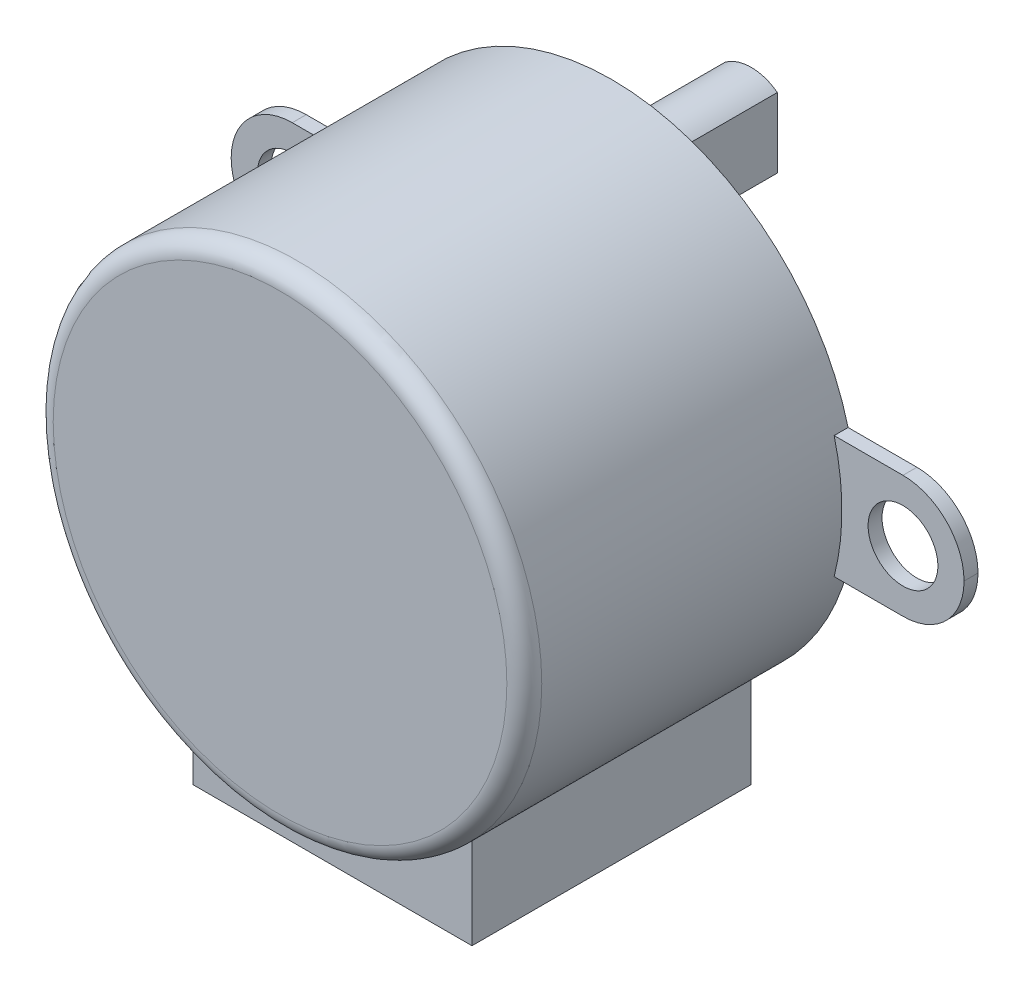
ISO-10303-21;
HEADER;
FILE_DESCRIPTION(('STEP AP214'),'2;1');
FILE_NAME('part.step','',(''),(''),'','','');
FILE_SCHEMA(('AUTOMOTIVE_DESIGN { 1 0 10303 214 1 1 1 1 }'));
ENDSEC;
DATA;
#1=APPLICATION_CONTEXT('core data for automotive mechanical design processes');
#2=APPLICATION_PROTOCOL_DEFINITION('international standard','automotive_design',2000,#1);
#3=PRODUCT_CONTEXT('',#1,'mechanical');
#4=PRODUCT('Part','Part','',(#3));
#5=PRODUCT_RELATED_PRODUCT_CATEGORY('part','',(#4));
#6=PRODUCT_DEFINITION_FORMATION('','',#4);
#7=PRODUCT_DEFINITION_CONTEXT('part definition',#1,'design');
#8=PRODUCT_DEFINITION('design','',#6,#7);
#9=PRODUCT_DEFINITION_SHAPE('','',#8);
#10=(LENGTH_UNIT() NAMED_UNIT(*) SI_UNIT(.MILLI.,.METRE.));
#11=(NAMED_UNIT(*) PLANE_ANGLE_UNIT() SI_UNIT($,.RADIAN.));
#12=(NAMED_UNIT(*) SI_UNIT($,.STERADIAN.) SOLID_ANGLE_UNIT());
#13=UNCERTAINTY_MEASURE_WITH_UNIT(LENGTH_MEASURE(1.E-05),#10,'distance_accuracy_value','');
#14=(GEOMETRIC_REPRESENTATION_CONTEXT(3) GLOBAL_UNCERTAINTY_ASSIGNED_CONTEXT((#13)) GLOBAL_UNIT_ASSIGNED_CONTEXT((#10,
#11,#12)) REPRESENTATION_CONTEXT('',''));
#15=CARTESIAN_POINT('',(0.,0.,0.));
#16=DIRECTION('',(0.,0.,1.));
#17=DIRECTION('',(1.,0.,0.));
#18=AXIS2_PLACEMENT_3D('',#15,#16,#17);
#19=CARTESIAN_POINT('',(0.,8.1,-1.));
#20=DIRECTION('',(0.,0.,-1.));
#21=DIRECTION('',(-1.,0.,0.));
#22=AXIS2_PLACEMENT_3D('',#19,#20,#21);
#23=PLANE('',#22);
#24=CARTESIAN_POINT('',(0.,8.1,-1.));
#25=DIRECTION('',(0.,0.,-1.));
#26=DIRECTION('',(-1.,0.,0.));
#27=AXIS2_PLACEMENT_3D('',#24,#25,#26);
#28=CIRCLE('',#27,4.6);
#29=CARTESIAN_POINT('',(-4.6,8.1,-1.));
#30=VERTEX_POINT('',#29);
#31=EDGE_CURVE('E175',#30,#30,#28,.T.);
#32=ORIENTED_EDGE('',*,*,#31,.T.);
#33=EDGE_LOOP('',(#32));
#34=FACE_BOUND('',#33,.T.);
#35=CARTESIAN_POINT('',(0.,8.1,-1.));
#36=DIRECTION('',(0.,0.,-1.));
#37=DIRECTION('',(-1.,0.,0.));
#38=AXIS2_PLACEMENT_3D('',#35,#36,#37);
#39=CIRCLE('',#38,2.5);
#40=CARTESIAN_POINT('',(-2.5,8.1,-1.));
#41=VERTEX_POINT('',#40);
#42=EDGE_CURVE('E181',#41,#41,#39,.T.);
#43=ORIENTED_EDGE('',*,*,#42,.F.);
#44=EDGE_LOOP('',(#43));
#45=FACE_BOUND('',#44,.T.);
#46=ADVANCED_FACE('F33',(#34,#45),#23,.T.);
#47=CARTESIAN_POINT('',(0.,0.,0.));
#48=DIRECTION('',(0.,0.,1.));
#49=DIRECTION('',(1.,0.,0.));
#50=AXIS2_PLACEMENT_3D('',#47,#48,#49);
#51=PLANE('',#50);
#52=CARTESIAN_POINT('',(17.5,0.,0.));
#53=DIRECTION('',(0.,0.,1.));
#54=DIRECTION('',(1.,0.,0.));
#55=AXIS2_PLACEMENT_3D('',#52,#53,#54);
#56=CIRCLE('',#55,3.5);
#57=CARTESIAN_POINT('',(17.5,3.5,0.));
#58=VERTEX_POINT('',#57);
#59=CARTESIAN_POINT('',(21.,0.,0.));
#60=VERTEX_POINT('',#59);
#61=EDGE_CURVE('E271',#58,#60,#56,.F.);
#62=ORIENTED_EDGE('',*,*,#61,.T.);
#63=CARTESIAN_POINT('',(17.5,0.,0.));
#64=DIRECTION('',(0.,0.,1.));
#65=DIRECTION('',(1.,0.,0.));
#66=AXIS2_PLACEMENT_3D('',#63,#64,#65);
#67=CIRCLE('',#66,3.5);
#68=CARTESIAN_POINT('',(17.5,-3.5,0.));
#69=VERTEX_POINT('',#68);
#70=EDGE_CURVE('E273',#60,#69,#67,.F.);
#71=ORIENTED_EDGE('',*,*,#70,.T.);
#72=DIRECTION('',(-1.,0.,0.));
#73=VECTOR('',#72,1.);
#74=CARTESIAN_POINT('',(21.,-3.5,0.));
#75=LINE('',#74,#73);
#76=CARTESIAN_POINT('',(13.555441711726,-3.5,0.));
#77=VERTEX_POINT('',#76);
#78=EDGE_CURVE('E210',#69,#77,#75,.T.);
#79=ORIENTED_EDGE('',*,*,#78,.T.);
#80=CARTESIAN_POINT('',(0.,0.,0.));
#81=DIRECTION('',(0.,0.,1.));
#82=DIRECTION('',(1.,0.,0.));
#83=AXIS2_PLACEMENT_3D('',#80,#81,#82);
#84=CIRCLE('',#83,14.);
#85=CARTESIAN_POINT('',(8.,-11.4891252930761,0.));
#86=VERTEX_POINT('',#85);
#87=EDGE_CURVE('E250',#86,#77,#84,.T.);
#88=ORIENTED_EDGE('',*,*,#87,.F.);
#89=DIRECTION('',(0.,-1.,0.));
#90=VECTOR('',#89,1.);
#91=CARTESIAN_POINT('',(8.,-2.,0.));
#92=LINE('',#91,#90);
#93=CARTESIAN_POINT('',(8.,-17.,0.));
#94=VERTEX_POINT('',#93);
#95=EDGE_CURVE('E236',#86,#94,#92,.T.);
#96=ORIENTED_EDGE('',*,*,#95,.T.);
#97=DIRECTION('',(-1.,0.,0.));
#98=VECTOR('',#97,1.);
#99=CARTESIAN_POINT('',(8.,-17.,0.));
#100=LINE('',#99,#98);
#101=CARTESIAN_POINT('',(-8.,-17.,0.));
#102=VERTEX_POINT('',#101);
#103=EDGE_CURVE('E228',#94,#102,#100,.T.);
#104=ORIENTED_EDGE('',*,*,#103,.T.);
#105=DIRECTION('',(0.,1.,0.));
#106=VECTOR('',#105,1.);
#107=CARTESIAN_POINT('',(-8.,-2.,0.));
#108=LINE('',#107,#106);
#109=CARTESIAN_POINT('',(-8.,-11.4891252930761,0.));
#110=VERTEX_POINT('',#109);
#111=EDGE_CURVE('E223',#102,#110,#108,.T.);
#112=ORIENTED_EDGE('',*,*,#111,.T.);
#113=CARTESIAN_POINT('',(-13.5554417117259,-3.5,0.));
#114=VERTEX_POINT('',#113);
#115=EDGE_CURVE('E249',#114,#110,#84,.T.);
#116=ORIENTED_EDGE('',*,*,#115,.F.);
#117=CARTESIAN_POINT('',(-17.5,-3.5,0.));
#118=VERTEX_POINT('',#117);
#119=EDGE_CURVE('E208',#114,#118,#75,.T.);
#120=ORIENTED_EDGE('',*,*,#119,.T.);
#121=CARTESIAN_POINT('',(-17.5,0.,0.));
#122=DIRECTION('',(0.,0.,1.));
#123=DIRECTION('',(1.,0.,0.));
#124=AXIS2_PLACEMENT_3D('',#121,#122,#123);
#125=CIRCLE('',#124,3.5);
#126=CARTESIAN_POINT('',(-21.,0.,0.));
#127=VERTEX_POINT('',#126);
#128=EDGE_CURVE('E269',#118,#127,#125,.F.);
#129=ORIENTED_EDGE('',*,*,#128,.T.);
#130=CARTESIAN_POINT('',(-17.5,0.,0.));
#131=DIRECTION('',(0.,0.,1.));
#132=DIRECTION('',(1.,0.,0.));
#133=AXIS2_PLACEMENT_3D('',#130,#131,#132);
#134=CIRCLE('',#133,3.5);
#135=CARTESIAN_POINT('',(-17.5,3.5,0.));
#136=VERTEX_POINT('',#135);
#137=EDGE_CURVE('E267',#127,#136,#134,.F.);
#138=ORIENTED_EDGE('',*,*,#137,.T.);
#139=DIRECTION('',(1.,0.,0.));
#140=VECTOR('',#139,1.);
#141=CARTESIAN_POINT('',(21.,3.5,0.));
#142=LINE('',#141,#140);
#143=CARTESIAN_POINT('',(-13.555441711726,3.5,0.));
#144=VERTEX_POINT('',#143);
#145=EDGE_CURVE('E206',#136,#144,#142,.T.);
#146=ORIENTED_EDGE('',*,*,#145,.T.);
#147=CARTESIAN_POINT('',(13.555441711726,3.5,0.));
#148=VERTEX_POINT('',#147);
#149=EDGE_CURVE('E254',#148,#144,#84,.T.);
#150=ORIENTED_EDGE('',*,*,#149,.F.);
#151=EDGE_CURVE('E209',#148,#58,#142,.T.);
#152=ORIENTED_EDGE('',*,*,#151,.T.);
#153=EDGE_LOOP('',(#62,#71,#79,#88,#96,#104,#112,#116,#120,#129,#138,#146,#150,#152));
#154=FACE_BOUND('',#153,.T.);
#155=CARTESIAN_POINT('',(17.5,0.,0.));
#156=DIRECTION('',(0.,0.,-1.));
#157=DIRECTION('',(-1.,0.,0.));
#158=AXIS2_PLACEMENT_3D('',#155,#156,#157);
#159=CIRCLE('',#158,2.);
#160=CARTESIAN_POINT('',(15.5,0.,0.));
#161=VERTEX_POINT('',#160);
#162=EDGE_CURVE('E190',#161,#161,#159,.T.);
#163=ORIENTED_EDGE('',*,*,#162,.F.);
#164=EDGE_LOOP('',(#163));
#165=FACE_BOUND('',#164,.T.);
#166=CARTESIAN_POINT('',(-17.5,0.,0.));
#167=DIRECTION('',(0.,0.,-1.));
#168=DIRECTION('',(1.,0.,0.));
#169=AXIS2_PLACEMENT_3D('',#166,#167,#168);
#170=CIRCLE('',#169,2.);
#171=CARTESIAN_POINT('',(-15.5,0.,0.));
#172=VERTEX_POINT('',#171);
#173=EDGE_CURVE('E179',#172,#172,#170,.T.);
#174=ORIENTED_EDGE('',*,*,#173,.F.);
#175=EDGE_LOOP('',(#174));
#176=FACE_BOUND('',#175,.T.);
#177=CARTESIAN_POINT('',(0.,8.1,0.));
#178=DIRECTION('',(0.,0.,1.));
#179=DIRECTION('',(1.,0.,0.));
#180=AXIS2_PLACEMENT_3D('',#177,#178,#179);
#181=CIRCLE('',#180,4.6);
#182=CARTESIAN_POINT('',(4.6,8.1,0.));
#183=VERTEX_POINT('',#182);
#184=EDGE_CURVE('E293',#183,#183,#181,.F.);
#185=ORIENTED_EDGE('',*,*,#184,.F.);
#186=EDGE_LOOP('',(#185));
#187=FACE_BOUND('',#186,.T.);
#188=ADVANCED_FACE('F324',(#154,#165,#176,#187),#51,.F.);
#189=CARTESIAN_POINT('',(0.,0.,19.));
#190=DIRECTION('',(0.,0.,-1.));
#191=DIRECTION('',(-1.,0.,0.));
#192=AXIS2_PLACEMENT_3D('',#189,#190,#191);
#193=CYLINDRICAL_SURFACE('',#192,14.);
#194=ORIENTED_EDGE('',*,*,#87,.T.);
#195=DIRECTION('',(0.,0.,-1.));
#196=VECTOR('',#195,1.);
#197=CARTESIAN_POINT('',(13.555441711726,-3.5,19.));
#198=LINE('',#197,#196);
#199=CARTESIAN_POINT('',(13.555441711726,-3.5,0.799999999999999));
#200=VERTEX_POINT('',#199);
#201=EDGE_CURVE('E217',#77,#200,#198,.F.);
#202=ORIENTED_EDGE('',*,*,#201,.T.);
#203=CARTESIAN_POINT('',(0.,0.,0.799999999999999));
#204=DIRECTION('',(0.,0.,-1.));
#205=DIRECTION('',(-1.,0.,0.));
#206=AXIS2_PLACEMENT_3D('',#203,#204,#205);
#207=CIRCLE('',#206,14.);
#208=CARTESIAN_POINT('',(13.555441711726,3.5,0.799999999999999));
#209=VERTEX_POINT('',#208);
#210=EDGE_CURVE('E266',#209,#200,#207,.T.);
#211=ORIENTED_EDGE('',*,*,#210,.F.);
#212=DIRECTION('',(0.,0.,-1.));
#213=VECTOR('',#212,1.);
#214=CARTESIAN_POINT('',(13.555441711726,3.5,19.));
#215=LINE('',#214,#213);
#216=EDGE_CURVE('E214',#209,#148,#215,.T.);
#217=ORIENTED_EDGE('',*,*,#216,.T.);
#218=ORIENTED_EDGE('',*,*,#149,.T.);
#219=DIRECTION('',(0.,0.,-1.));
#220=VECTOR('',#219,1.);
#221=CARTESIAN_POINT('',(-13.555441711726,3.5,19.));
#222=LINE('',#221,#220);
#223=CARTESIAN_POINT('',(-13.555441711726,3.5,0.799999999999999));
#224=VERTEX_POINT('',#223);
#225=EDGE_CURVE('E205',#144,#224,#222,.F.);
#226=ORIENTED_EDGE('',*,*,#225,.T.);
#227=CARTESIAN_POINT('',(-13.555441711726,-3.5,0.799999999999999));
#228=VERTEX_POINT('',#227);
#229=EDGE_CURVE('E263',#228,#224,#207,.T.);
#230=ORIENTED_EDGE('',*,*,#229,.F.);
#231=DIRECTION('',(0.,0.,-1.));
#232=VECTOR('',#231,1.);
#233=CARTESIAN_POINT('',(-13.555441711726,-3.5,19.));
#234=LINE('',#233,#232);
#235=EDGE_CURVE('E220',#228,#114,#234,.T.);
#236=ORIENTED_EDGE('',*,*,#235,.T.);
#237=ORIENTED_EDGE('',*,*,#115,.T.);
#238=DIRECTION('',(0.,0.,-1.));
#239=VECTOR('',#238,1.);
#240=CARTESIAN_POINT('',(-8.,-11.4891252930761,19.));
#241=LINE('',#240,#239);
#242=CARTESIAN_POINT('',(-8.,-11.4891252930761,16.));
#243=VERTEX_POINT('',#242);
#244=EDGE_CURVE('E247',#110,#243,#241,.F.);
#245=ORIENTED_EDGE('',*,*,#244,.T.);
#246=CARTESIAN_POINT('',(0.,0.,16.));
#247=DIRECTION('',(0.,0.,-1.));
#248=DIRECTION('',(-1.,0.,0.));
#249=AXIS2_PLACEMENT_3D('',#246,#247,#248);
#250=CIRCLE('',#249,14.);
#251=CARTESIAN_POINT('',(8.,-11.4891252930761,16.));
#252=VERTEX_POINT('',#251);
#253=EDGE_CURVE('E253',#252,#243,#250,.T.);
#254=ORIENTED_EDGE('',*,*,#253,.F.);
#255=DIRECTION('',(0.,0.,-1.));
#256=VECTOR('',#255,1.);
#257=CARTESIAN_POINT('',(8.,-11.4891252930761,19.));
#258=LINE('',#257,#256);
#259=EDGE_CURVE('E242',#252,#86,#258,.T.);
#260=ORIENTED_EDGE('',*,*,#259,.T.);
#261=EDGE_LOOP('',(#194,#202,#211,#217,#218,#226,#230,#236,#237,#245,#254,#260));
#262=FACE_BOUND('',#261,.T.);
#263=CARTESIAN_POINT('',(0.,0.,18.));
#264=DIRECTION('',(0.,0.,1.));
#265=DIRECTION('',(1.,0.,0.));
#266=AXIS2_PLACEMENT_3D('',#263,#264,#265);
#267=CIRCLE('',#266,14.);
#268=CARTESIAN_POINT('',(14.,0.,18.));
#269=VERTEX_POINT('',#268);
#270=EDGE_CURVE('E260',#269,#269,#267,.F.);
#271=ORIENTED_EDGE('',*,*,#270,.T.);
#272=EDGE_LOOP('',(#271));
#273=FACE_BOUND('',#272,.T.);
#274=ADVANCED_FACE('F330',(#262,#273),#193,.T.);
#275=CARTESIAN_POINT('',(0.,0.,19.));
#276=DIRECTION('',(0.,0.,1.));
#277=DIRECTION('',(1.,0.,0.));
#278=AXIS2_PLACEMENT_3D('',#275,#276,#277);
#279=PLANE('',#278);
#280=CARTESIAN_POINT('',(0.,0.,19.));
#281=DIRECTION('',(0.,0.,1.));
#282=DIRECTION('',(1.,0.,0.));
#283=AXIS2_PLACEMENT_3D('',#280,#281,#282);
#284=CIRCLE('',#283,13.);
#285=CARTESIAN_POINT('',(13.,0.,19.));
#286=VERTEX_POINT('',#285);
#287=EDGE_CURVE('E257',#286,#286,#284,.T.);
#288=ORIENTED_EDGE('',*,*,#287,.T.);
#289=EDGE_LOOP('',(#288));
#290=FACE_BOUND('',#289,.T.);
#291=ADVANCED_FACE('F370',(#290),#279,.T.);
#292=CARTESIAN_POINT('',(0.,0.,16.));
#293=DIRECTION('',(0.,0.,-1.));
#294=DIRECTION('',(-1.,0.,0.));
#295=AXIS2_PLACEMENT_3D('',#292,#293,#294);
#296=PLANE('',#295);
#297=DIRECTION('',(0.,-1.,0.));
#298=VECTOR('',#297,1.);
#299=CARTESIAN_POINT('',(8.,-2.,16.));
#300=LINE('',#299,#298);
#301=CARTESIAN_POINT('',(8.,-17.,16.));
#302=VERTEX_POINT('',#301);
#303=EDGE_CURVE('E227',#252,#302,#300,.T.);
#304=ORIENTED_EDGE('',*,*,#303,.F.);
#305=ORIENTED_EDGE('',*,*,#253,.T.);
#306=DIRECTION('',(0.,1.,0.));
#307=VECTOR('',#306,1.);
#308=CARTESIAN_POINT('',(-8.,-2.,16.));
#309=LINE('',#308,#307);
#310=CARTESIAN_POINT('',(-8.,-17.,16.));
#311=VERTEX_POINT('',#310);
#312=EDGE_CURVE('E224',#311,#243,#309,.T.);
#313=ORIENTED_EDGE('',*,*,#312,.F.);
#314=DIRECTION('',(-1.,0.,0.));
#315=VECTOR('',#314,1.);
#316=CARTESIAN_POINT('',(8.,-17.,16.));
#317=LINE('',#316,#315);
#318=EDGE_CURVE('E230',#302,#311,#317,.T.);
#319=ORIENTED_EDGE('',*,*,#318,.F.);
#320=EDGE_LOOP('',(#304,#305,#313,#319));
#321=FACE_BOUND('',#320,.T.);
#322=ADVANCED_FACE('F366',(#321),#296,.F.);
#323=CARTESIAN_POINT('',(-8.,-2.,16.));
#324=DIRECTION('',(-1.,0.,0.));
#325=DIRECTION('',(0.,-1.,0.));
#326=AXIS2_PLACEMENT_3D('',#323,#324,#325);
#327=PLANE('',#326);
#328=ORIENTED_EDGE('',*,*,#244,.F.);
#329=ORIENTED_EDGE('',*,*,#111,.F.);
#330=DIRECTION('',(0.,0.,-1.));
#331=VECTOR('',#330,1.);
#332=CARTESIAN_POINT('',(-8.,-17.,16.));
#333=LINE('',#332,#331);
#334=EDGE_CURVE('E240',#311,#102,#333,.T.);
#335=ORIENTED_EDGE('',*,*,#334,.F.);
#336=ORIENTED_EDGE('',*,*,#312,.T.);
#337=EDGE_LOOP('',(#328,#329,#335,#336));
#338=FACE_BOUND('',#337,.T.);
#339=ADVANCED_FACE('F369',(#338),#327,.T.);
#340=CARTESIAN_POINT('',(8.,-2.,16.));
#341=DIRECTION('',(1.,0.,0.));
#342=DIRECTION('',(0.,1.,0.));
#343=AXIS2_PLACEMENT_3D('',#340,#341,#342);
#344=PLANE('',#343);
#345=ORIENTED_EDGE('',*,*,#259,.F.);
#346=ORIENTED_EDGE('',*,*,#303,.T.);
#347=DIRECTION('',(0.,0.,-1.));
#348=VECTOR('',#347,1.);
#349=CARTESIAN_POINT('',(8.,-17.,16.));
#350=LINE('',#349,#348);
#351=EDGE_CURVE('E233',#302,#94,#350,.T.);
#352=ORIENTED_EDGE('',*,*,#351,.T.);
#353=ORIENTED_EDGE('',*,*,#95,.F.);
#354=EDGE_LOOP('',(#345,#346,#352,#353));
#355=FACE_BOUND('',#354,.T.);
#356=ADVANCED_FACE('F376',(#355),#344,.T.);
#357=CARTESIAN_POINT('',(8.,-17.,16.));
#358=DIRECTION('',(0.,-1.,0.));
#359=DIRECTION('',(0.,0.,-1.));
#360=AXIS2_PLACEMENT_3D('',#357,#358,#359);
#361=PLANE('',#360);
#362=ORIENTED_EDGE('',*,*,#103,.F.);
#363=ORIENTED_EDGE('',*,*,#351,.F.);
#364=ORIENTED_EDGE('',*,*,#318,.T.);
#365=ORIENTED_EDGE('',*,*,#334,.T.);
#366=EDGE_LOOP('',(#362,#363,#364,#365));
#367=FACE_BOUND('',#366,.T.);
#368=ADVANCED_FACE('F372',(#367),#361,.T.);
#369=CARTESIAN_POINT('',(0.,0.,18.));
#370=DIRECTION('',(0.,0.,1.));
#371=DIRECTION('',(1.,0.,0.));
#372=AXIS2_PLACEMENT_3D('',#369,#370,#371);
#373=TOROIDAL_SURFACE('',#372,13.,1.);
#374=ORIENTED_EDGE('',*,*,#270,.F.);
#375=EDGE_LOOP('',(#374));
#376=FACE_BOUND('',#375,.T.);
#377=ORIENTED_EDGE('',*,*,#287,.F.);
#378=EDGE_LOOP('',(#377));
#379=FACE_BOUND('',#378,.T.);
#380=ADVANCED_FACE('F375',(#376,#379),#373,.T.);
#381=CARTESIAN_POINT('',(0.,0.,0.8));
#382=DIRECTION('',(0.,0.,-1.));
#383=DIRECTION('',(-1.,0.,0.));
#384=AXIS2_PLACEMENT_3D('',#381,#382,#383);
#385=PLANE('',#384);
#386=CARTESIAN_POINT('',(-17.5,0.,0.8));
#387=DIRECTION('',(0.,0.,-1.));
#388=DIRECTION('',(1.,0.,0.));
#389=AXIS2_PLACEMENT_3D('',#386,#387,#388);
#390=CIRCLE('',#389,2.);
#391=CARTESIAN_POINT('',(-15.5,0.,0.8));
#392=VERTEX_POINT('',#391);
#393=EDGE_CURVE('E187',#392,#392,#390,.T.);
#394=ORIENTED_EDGE('',*,*,#393,.T.);
#395=EDGE_LOOP('',(#394));
#396=FACE_BOUND('',#395,.T.);
#397=CARTESIAN_POINT('',(-17.5,0.,0.8));
#398=DIRECTION('',(0.,0.,-1.));
#399=DIRECTION('',(-1.,0.,0.));
#400=AXIS2_PLACEMENT_3D('',#397,#398,#399);
#401=CIRCLE('',#400,3.5);
#402=CARTESIAN_POINT('',(-17.5,3.5,0.8));
#403=VERTEX_POINT('',#402);
#404=CARTESIAN_POINT('',(-21.,0.,0.8));
#405=VERTEX_POINT('',#404);
#406=EDGE_CURVE('E287',#403,#405,#401,.F.);
#407=ORIENTED_EDGE('',*,*,#406,.T.);
#408=CARTESIAN_POINT('',(-17.5,0.,0.8));
#409=DIRECTION('',(0.,0.,-1.));
#410=DIRECTION('',(-1.,0.,0.));
#411=AXIS2_PLACEMENT_3D('',#408,#409,#410);
#412=CIRCLE('',#411,3.5);
#413=CARTESIAN_POINT('',(-17.5,-3.5,0.8));
#414=VERTEX_POINT('',#413);
#415=EDGE_CURVE('E289',#405,#414,#412,.F.);
#416=ORIENTED_EDGE('',*,*,#415,.T.);
#417=DIRECTION('',(-1.,0.,0.));
#418=VECTOR('',#417,1.);
#419=CARTESIAN_POINT('',(21.,-3.5,0.8));
#420=LINE('',#419,#418);
#421=EDGE_CURVE('E201',#228,#414,#420,.T.);
#422=ORIENTED_EDGE('',*,*,#421,.F.);
#423=ORIENTED_EDGE('',*,*,#229,.T.);
#424=DIRECTION('',(1.,0.,0.));
#425=VECTOR('',#424,1.);
#426=CARTESIAN_POINT('',(21.,3.5,0.8));
#427=LINE('',#426,#425);
#428=EDGE_CURVE('E199',#403,#224,#427,.T.);
#429=ORIENTED_EDGE('',*,*,#428,.F.);
#430=EDGE_LOOP('',(#407,#416,#422,#423,#429));
#431=FACE_BOUND('',#430,.T.);
#432=ADVANCED_FACE('F356',(#396,#431),#385,.F.);
#433=CARTESIAN_POINT('',(21.,3.5,0.8));
#434=DIRECTION('',(0.,1.,0.));
#435=DIRECTION('',(0.,0.,1.));
#436=AXIS2_PLACEMENT_3D('',#433,#434,#435);
#437=PLANE('',#436);
#438=ORIENTED_EDGE('',*,*,#145,.F.);
#439=DIRECTION('',(0.,0.,-1.));
#440=VECTOR('',#439,1.);
#441=CARTESIAN_POINT('',(-17.5,3.5,0.8));
#442=LINE('',#441,#440);
#443=EDGE_CURVE('E291',#136,#403,#442,.F.);
#444=ORIENTED_EDGE('',*,*,#443,.T.);
#445=ORIENTED_EDGE('',*,*,#428,.T.);
#446=ORIENTED_EDGE('',*,*,#225,.F.);
#447=EDGE_LOOP('',(#438,#444,#445,#446));
#448=FACE_BOUND('',#447,.T.);
#449=ADVANCED_FACE('F359',(#448),#437,.T.);
#450=CARTESIAN_POINT('',(21.,-3.5,0.8));
#451=DIRECTION('',(0.,-1.,0.));
#452=DIRECTION('',(0.,0.,-1.));
#453=AXIS2_PLACEMENT_3D('',#450,#451,#452);
#454=PLANE('',#453);
#455=ORIENTED_EDGE('',*,*,#421,.T.);
#456=DIRECTION('',(0.,0.,-1.));
#457=VECTOR('',#456,1.);
#458=CARTESIAN_POINT('',(-17.5,-3.5,0.8));
#459=LINE('',#458,#457);
#460=EDGE_CURVE('E284',#414,#118,#459,.T.);
#461=ORIENTED_EDGE('',*,*,#460,.T.);
#462=ORIENTED_EDGE('',*,*,#119,.F.);
#463=ORIENTED_EDGE('',*,*,#235,.F.);
#464=EDGE_LOOP('',(#455,#461,#462,#463));
#465=FACE_BOUND('',#464,.T.);
#466=ADVANCED_FACE('F354',(#465),#454,.T.);
#467=CARTESIAN_POINT('',(17.5,0.,0.8));
#468=DIRECTION('',(0.,0.,-1.));
#469=DIRECTION('',(-1.,0.,0.));
#470=AXIS2_PLACEMENT_3D('',#467,#468,#469);
#471=CIRCLE('',#470,2.);
#472=CARTESIAN_POINT('',(15.5,0.,0.8));
#473=VERTEX_POINT('',#472);
#474=EDGE_CURVE('E193',#473,#473,#471,.T.);
#475=ORIENTED_EDGE('',*,*,#474,.T.);
#476=EDGE_LOOP('',(#475));
#477=FACE_BOUND('',#476,.T.);
#478=CARTESIAN_POINT('',(17.5,-3.5,0.8));
#479=VERTEX_POINT('',#478);
#480=EDGE_CURVE('E203',#479,#200,#420,.T.);
#481=ORIENTED_EDGE('',*,*,#480,.F.);
#482=CARTESIAN_POINT('',(17.5,0.,0.8));
#483=DIRECTION('',(0.,0.,-1.));
#484=DIRECTION('',(-1.,0.,0.));
#485=AXIS2_PLACEMENT_3D('',#482,#483,#484);
#486=CIRCLE('',#485,3.5);
#487=CARTESIAN_POINT('',(21.,0.,0.8));
#488=VERTEX_POINT('',#487);
#489=EDGE_CURVE('E280',#479,#488,#486,.F.);
#490=ORIENTED_EDGE('',*,*,#489,.T.);
#491=CARTESIAN_POINT('',(17.5,0.,0.8));
#492=DIRECTION('',(0.,0.,-1.));
#493=DIRECTION('',(-1.,0.,0.));
#494=AXIS2_PLACEMENT_3D('',#491,#492,#493);
#495=CIRCLE('',#494,3.5);
#496=CARTESIAN_POINT('',(17.5,3.5,0.8));
#497=VERTEX_POINT('',#496);
#498=EDGE_CURVE('E278',#488,#497,#495,.F.);
#499=ORIENTED_EDGE('',*,*,#498,.T.);
#500=EDGE_CURVE('E202',#209,#497,#427,.T.);
#501=ORIENTED_EDGE('',*,*,#500,.F.);
#502=ORIENTED_EDGE('',*,*,#210,.T.);
#503=EDGE_LOOP('',(#481,#490,#499,#501,#502));
#504=FACE_BOUND('',#503,.T.);
#505=ADVANCED_FACE('F350',(#477,#504),#385,.F.);
#506=ORIENTED_EDGE('',*,*,#78,.F.);
#507=DIRECTION('',(0.,0.,-1.));
#508=VECTOR('',#507,1.);
#509=CARTESIAN_POINT('',(17.5,-3.5,0.8));
#510=LINE('',#509,#508);
#511=EDGE_CURVE('E275',#69,#479,#510,.F.);
#512=ORIENTED_EDGE('',*,*,#511,.T.);
#513=ORIENTED_EDGE('',*,*,#480,.T.);
#514=ORIENTED_EDGE('',*,*,#201,.F.);
#515=EDGE_LOOP('',(#506,#512,#513,#514));
#516=FACE_BOUND('',#515,.T.);
#517=ADVANCED_FACE('F353',(#516),#454,.T.);
#518=ORIENTED_EDGE('',*,*,#500,.T.);
#519=DIRECTION('',(0.,0.,-1.));
#520=VECTOR('',#519,1.);
#521=CARTESIAN_POINT('',(17.5,3.5,0.8));
#522=LINE('',#521,#520);
#523=EDGE_CURVE('E282',#497,#58,#522,.T.);
#524=ORIENTED_EDGE('',*,*,#523,.T.);
#525=ORIENTED_EDGE('',*,*,#151,.F.);
#526=ORIENTED_EDGE('',*,*,#216,.F.);
#527=EDGE_LOOP('',(#518,#524,#525,#526));
#528=FACE_BOUND('',#527,.T.);
#529=ADVANCED_FACE('F361',(#528),#437,.T.);
#530=CARTESIAN_POINT('',(17.5,0.,0.8));
#531=DIRECTION('',(0.,0.,-1.));
#532=DIRECTION('',(-1.,0.,0.));
#533=AXIS2_PLACEMENT_3D('',#530,#531,#532);
#534=CYLINDRICAL_SURFACE('',#533,3.5);
#535=ORIENTED_EDGE('',*,*,#523,.F.);
#536=ORIENTED_EDGE('',*,*,#498,.F.);
#537=DIRECTION('',(0.,0.,-1.));
#538=VECTOR('',#537,1.);
#539=CARTESIAN_POINT('',(21.,0.,0.8));
#540=LINE('',#539,#538);
#541=EDGE_CURVE('E294',#60,#488,#540,.F.);
#542=ORIENTED_EDGE('',*,*,#541,.F.);
#543=ORIENTED_EDGE('',*,*,#61,.F.);
#544=EDGE_LOOP('',(#535,#536,#542,#543));
#545=FACE_BOUND('',#544,.T.);
#546=ADVANCED_FACE('F364',(#545),#534,.T.);
#547=CARTESIAN_POINT('',(17.5,0.,0.8));
#548=DIRECTION('',(0.,0.,-1.));
#549=DIRECTION('',(-1.,0.,0.));
#550=AXIS2_PLACEMENT_3D('',#547,#548,#549);
#551=CYLINDRICAL_SURFACE('',#550,3.5);
#552=ORIENTED_EDGE('',*,*,#489,.F.);
#553=ORIENTED_EDGE('',*,*,#511,.F.);
#554=ORIENTED_EDGE('',*,*,#70,.F.);
#555=ORIENTED_EDGE('',*,*,#541,.T.);
#556=EDGE_LOOP('',(#552,#553,#554,#555));
#557=FACE_BOUND('',#556,.T.);
#558=ADVANCED_FACE('F393',(#557),#551,.T.);
#559=CARTESIAN_POINT('',(-17.5,0.,0.8));
#560=DIRECTION('',(0.,0.,-1.));
#561=DIRECTION('',(-1.,0.,0.));
#562=AXIS2_PLACEMENT_3D('',#559,#560,#561);
#563=CYLINDRICAL_SURFACE('',#562,3.5);
#564=DIRECTION('',(0.,0.,-1.));
#565=VECTOR('',#564,1.);
#566=CARTESIAN_POINT('',(-21.,0.,0.8));
#567=LINE('',#566,#565);
#568=EDGE_CURVE('E196',#405,#127,#567,.T.);
#569=ORIENTED_EDGE('',*,*,#568,.F.);
#570=ORIENTED_EDGE('',*,*,#406,.F.);
#571=ORIENTED_EDGE('',*,*,#443,.F.);
#572=ORIENTED_EDGE('',*,*,#137,.F.);
#573=EDGE_LOOP('',(#569,#570,#571,#572));
#574=FACE_BOUND('',#573,.T.);
#575=ADVANCED_FACE('F35',(#574),#563,.T.);
#576=CARTESIAN_POINT('',(-17.5,0.,0.8));
#577=DIRECTION('',(0.,0.,-1.));
#578=DIRECTION('',(-1.,0.,0.));
#579=AXIS2_PLACEMENT_3D('',#576,#577,#578);
#580=CYLINDRICAL_SURFACE('',#579,3.5);
#581=ORIENTED_EDGE('',*,*,#415,.F.);
#582=ORIENTED_EDGE('',*,*,#568,.T.);
#583=ORIENTED_EDGE('',*,*,#128,.F.);
#584=ORIENTED_EDGE('',*,*,#460,.F.);
#585=EDGE_LOOP('',(#581,#582,#583,#584));
#586=FACE_BOUND('',#585,.T.);
#587=ADVANCED_FACE('F348',(#586),#580,.T.);
#588=CARTESIAN_POINT('',(17.5,0.,0.8));
#589=DIRECTION('',(0.,0.,-1.));
#590=DIRECTION('',(-1.,0.,0.));
#591=AXIS2_PLACEMENT_3D('',#588,#589,#590);
#592=CYLINDRICAL_SURFACE('',#591,2.);
#593=ORIENTED_EDGE('',*,*,#474,.F.);
#594=EDGE_LOOP('',(#593));
#595=FACE_BOUND('',#594,.T.);
#596=ORIENTED_EDGE('',*,*,#162,.T.);
#597=EDGE_LOOP('',(#596));
#598=FACE_BOUND('',#597,.T.);
#599=ADVANCED_FACE('F344',(#595,#598),#592,.F.);
#600=CARTESIAN_POINT('',(-17.5,0.,0.8));
#601=DIRECTION('',(0.,0.,-1.));
#602=DIRECTION('',(-1.,0.,0.));
#603=AXIS2_PLACEMENT_3D('',#600,#601,#602);
#604=CYLINDRICAL_SURFACE('',#603,2.);
#605=ORIENTED_EDGE('',*,*,#393,.F.);
#606=EDGE_LOOP('',(#605));
#607=FACE_BOUND('',#606,.T.);
#608=ORIENTED_EDGE('',*,*,#173,.T.);
#609=EDGE_LOOP('',(#608));
#610=FACE_BOUND('',#609,.T.);
#611=ADVANCED_FACE('F340',(#607,#610),#604,.F.);
#612=CARTESIAN_POINT('',(0.,8.1,-1.));
#613=DIRECTION('',(0.,0.,1.));
#614=DIRECTION('',(1.,0.,0.));
#615=AXIS2_PLACEMENT_3D('',#612,#613,#614);
#616=CYLINDRICAL_SURFACE('',#615,4.6);
#617=ORIENTED_EDGE('',*,*,#31,.F.);
#618=EDGE_LOOP('',(#617));
#619=FACE_BOUND('',#618,.T.);
#620=ORIENTED_EDGE('',*,*,#184,.T.);
#621=EDGE_LOOP('',(#620));
#622=FACE_BOUND('',#621,.T.);
#623=ADVANCED_FACE('F337',(#619,#622),#616,.T.);
#624=CARTESIAN_POINT('',(0.,8.1,-8.));
#625=DIRECTION('',(0.,0.,1.));
#626=DIRECTION('',(1.,0.,0.));
#627=AXIS2_PLACEMENT_3D('',#624,#625,#626);
#628=CYLINDRICAL_SURFACE('',#627,2.5);
#629=CARTESIAN_POINT('',(0.,8.1,-8.));
#630=DIRECTION('',(0.,0.,-1.));
#631=DIRECTION('',(-1.,0.,0.));
#632=AXIS2_PLACEMENT_3D('',#629,#630,#631);
#633=CIRCLE('',#632,2.5);
#634=CARTESIAN_POINT('',(1.5,6.1,-8.));
#635=VERTEX_POINT('',#634);
#636=CARTESIAN_POINT('',(-1.5,6.1,-8.));
#637=VERTEX_POINT('',#636);
#638=EDGE_CURVE('E176',#635,#637,#633,.T.);
#639=ORIENTED_EDGE('',*,*,#638,.F.);
#640=DIRECTION('',(0.,0.,1.));
#641=VECTOR('',#640,1.);
#642=CARTESIAN_POINT('',(1.5,6.1,-8.));
#643=LINE('',#642,#641);
#644=CARTESIAN_POINT('',(1.5,6.1,-3.));
#645=VERTEX_POINT('',#644);
#646=EDGE_CURVE('E48',#635,#645,#643,.T.);
#647=ORIENTED_EDGE('',*,*,#646,.T.);
#648=CARTESIAN_POINT('',(0.,8.1,-3.));
#649=DIRECTION('',(0.,0.,1.));
#650=DIRECTION('',(1.,0.,0.));
#651=AXIS2_PLACEMENT_3D('',#648,#649,#650);
#652=CIRCLE('',#651,2.5);
#653=CARTESIAN_POINT('',(1.5,10.1,-3.));
#654=VERTEX_POINT('',#653);
#655=EDGE_CURVE('E11',#645,#654,#652,.T.);
#656=ORIENTED_EDGE('',*,*,#655,.T.);
#657=DIRECTION('',(0.,0.,1.));
#658=VECTOR('',#657,1.);
#659=CARTESIAN_POINT('',(1.5,10.1,-8.));
#660=LINE('',#659,#658);
#661=CARTESIAN_POINT('',(1.5,10.1,-8.));
#662=VERTEX_POINT('',#661);
#663=EDGE_CURVE('E160',#654,#662,#660,.F.);
#664=ORIENTED_EDGE('',*,*,#663,.T.);
#665=CARTESIAN_POINT('',(-1.5,10.1,-8.));
#666=VERTEX_POINT('',#665);
#667=EDGE_CURVE('E170',#666,#662,#633,.T.);
#668=ORIENTED_EDGE('',*,*,#667,.F.);
#669=DIRECTION('',(0.,0.,1.));
#670=VECTOR('',#669,1.);
#671=CARTESIAN_POINT('',(-1.5,10.1,-8.));
#672=LINE('',#671,#670);
#673=CARTESIAN_POINT('',(-1.5,10.1,-3.));
#674=VERTEX_POINT('',#673);
#675=EDGE_CURVE('E56',#666,#674,#672,.T.);
#676=ORIENTED_EDGE('',*,*,#675,.T.);
#677=CARTESIAN_POINT('',(0.,8.1,-3.));
#678=DIRECTION('',(0.,0.,-1.));
#679=DIRECTION('',(-1.,0.,0.));
#680=AXIS2_PLACEMENT_3D('',#677,#678,#679);
#681=CIRCLE('',#680,2.5);
#682=CARTESIAN_POINT('',(-1.5,6.1,-3.));
#683=VERTEX_POINT('',#682);
#684=EDGE_CURVE('E165',#683,#674,#681,.T.);
#685=ORIENTED_EDGE('',*,*,#684,.F.);
#686=DIRECTION('',(0.,0.,1.));
#687=VECTOR('',#686,1.);
#688=CARTESIAN_POINT('',(-1.5,6.1,-8.));
#689=LINE('',#688,#687);
#690=EDGE_CURVE('E309',#683,#637,#689,.F.);
#691=ORIENTED_EDGE('',*,*,#690,.T.);
#692=EDGE_LOOP('',(#639,#647,#656,#664,#668,#676,#685,#691));
#693=FACE_BOUND('',#692,.T.);
#694=ORIENTED_EDGE('',*,*,#42,.T.);
#695=EDGE_LOOP('',(#694));
#696=FACE_BOUND('',#695,.T.);
#697=ADVANCED_FACE('F168',(#693,#696),#628,.T.);
#698=CARTESIAN_POINT('',(0.,8.1,-8.));
#699=DIRECTION('',(0.,0.,-1.));
#700=DIRECTION('',(-1.,0.,0.));
#701=AXIS2_PLACEMENT_3D('',#698,#699,#700);
#702=PLANE('',#701);
#703=DIRECTION('',(0.,1.,0.));
#704=VECTOR('',#703,1.);
#705=CARTESIAN_POINT('',(1.5,8.1,-8.));
#706=LINE('',#705,#704);
#707=EDGE_CURVE('E41',#635,#662,#706,.T.);
#708=ORIENTED_EDGE('',*,*,#707,.F.);
#709=ORIENTED_EDGE('',*,*,#638,.T.);
#710=DIRECTION('',(0.,-1.,0.));
#711=VECTOR('',#710,1.);
#712=CARTESIAN_POINT('',(-1.5,8.1,-8.));
#713=LINE('',#712,#711);
#714=EDGE_CURVE('E174',#666,#637,#713,.T.);
#715=ORIENTED_EDGE('',*,*,#714,.F.);
#716=ORIENTED_EDGE('',*,*,#667,.T.);
#717=EDGE_LOOP('',(#708,#709,#715,#716));
#718=FACE_BOUND('',#717,.T.);
#719=ADVANCED_FACE('F173',(#718),#702,.T.);
#720=CARTESIAN_POINT('',(0.,0.,-3.));
#721=DIRECTION('',(0.,0.,-1.));
#722=DIRECTION('',(-1.,0.,0.));
#723=AXIS2_PLACEMENT_3D('',#720,#721,#722);
#724=PLANE('',#723);
#725=ORIENTED_EDGE('',*,*,#684,.T.);
#726=DIRECTION('',(0.,-1.,0.));
#727=VECTOR('',#726,1.);
#728=CARTESIAN_POINT('',(-1.5,11.1338054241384,-3.));
#729=LINE('',#728,#727);
#730=EDGE_CURVE('E306',#674,#683,#729,.T.);
#731=ORIENTED_EDGE('',*,*,#730,.T.);
#732=EDGE_LOOP('',(#725,#731));
#733=FACE_BOUND('',#732,.T.);
#734=ADVANCED_FACE('F305',(#733),#724,.T.);
#735=CARTESIAN_POINT('',(-1.5,11.1338054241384,-3.));
#736=DIRECTION('',(1.,0.,0.));
#737=DIRECTION('',(0.,1.,0.));
#738=AXIS2_PLACEMENT_3D('',#735,#736,#737);
#739=PLANE('',#738);
#740=ORIENTED_EDGE('',*,*,#714,.T.);
#741=ORIENTED_EDGE('',*,*,#690,.F.);
#742=ORIENTED_EDGE('',*,*,#730,.F.);
#743=ORIENTED_EDGE('',*,*,#675,.F.);
#744=EDGE_LOOP('',(#740,#741,#742,#743));
#745=FACE_BOUND('',#744,.T.);
#746=ADVANCED_FACE('F308',(#745),#739,.F.);
#747=CARTESIAN_POINT('',(0.,0.,-3.));
#748=DIRECTION('',(0.,0.,1.));
#749=DIRECTION('',(1.,0.,0.));
#750=AXIS2_PLACEMENT_3D('',#747,#748,#749);
#751=PLANE('',#750);
#752=DIRECTION('',(0.,1.,0.));
#753=VECTOR('',#752,1.);
#754=CARTESIAN_POINT('',(1.5,11.1338054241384,-3.));
#755=LINE('',#754,#753);
#756=EDGE_CURVE('E171',#645,#654,#755,.T.);
#757=ORIENTED_EDGE('',*,*,#756,.T.);
#758=ORIENTED_EDGE('',*,*,#655,.F.);
#759=EDGE_LOOP('',(#757,#758));
#760=FACE_BOUND('',#759,.T.);
#761=ADVANCED_FACE('F314',(#760),#751,.F.);
#762=CARTESIAN_POINT('',(1.5,11.1338054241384,-3.));
#763=DIRECTION('',(-1.,0.,0.));
#764=DIRECTION('',(0.,-1.,0.));
#765=AXIS2_PLACEMENT_3D('',#762,#763,#764);
#766=PLANE('',#765);
#767=ORIENTED_EDGE('',*,*,#707,.T.);
#768=ORIENTED_EDGE('',*,*,#663,.F.);
#769=ORIENTED_EDGE('',*,*,#756,.F.);
#770=ORIENTED_EDGE('',*,*,#646,.F.);
#771=EDGE_LOOP('',(#767,#768,#769,#770));
#772=FACE_BOUND('',#771,.T.);
#773=ADVANCED_FACE('F159',(#772),#766,.F.);
#774=CLOSED_SHELL('',(#46,#188,#274,#291,#322,#339,#356,#368,#380,#432,#449,#466,#505,#517,#529,
#546,#558,#575,#587,#599,#611,#623,#697,#719,#734,#746,#761,#773));
#775=MANIFOLD_SOLID_BREP('B2',#774);
#776=ADVANCED_BREP_SHAPE_REPRESENTATION('',(#18,#775),#14);
#777=SHAPE_DEFINITION_REPRESENTATION(#9,#776);
ENDSEC;
END-ISO-10303-21;
